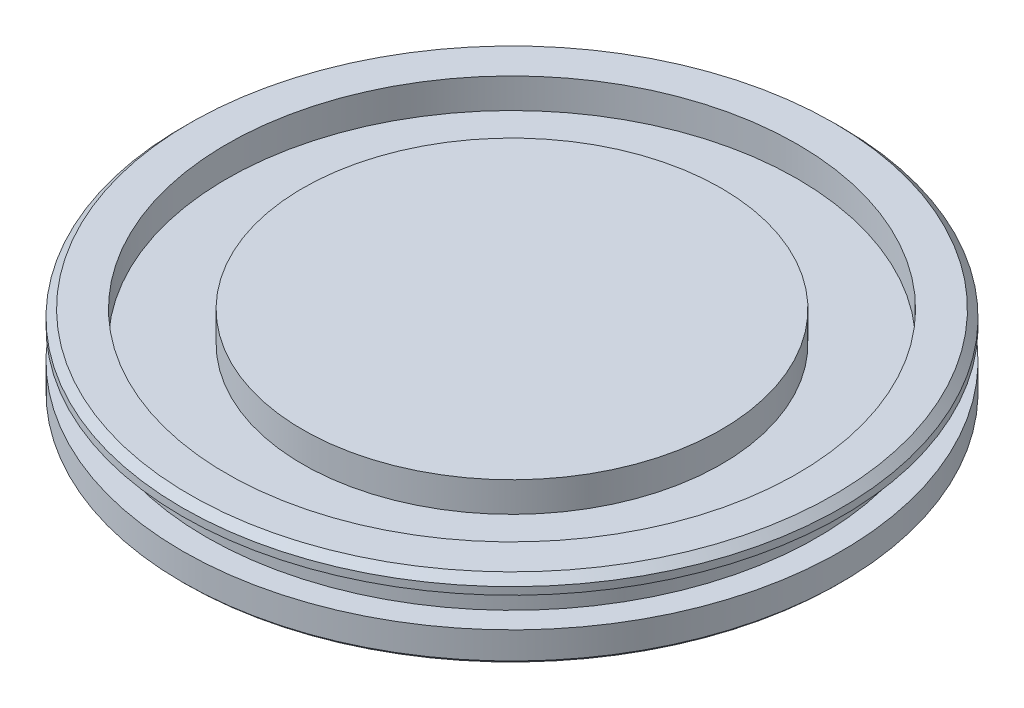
ISO-10303-21;
HEADER;
FILE_DESCRIPTION(('STEP AP214'),'2;1');
FILE_NAME('part.step','',(''),(''),'','','');
FILE_SCHEMA(('AUTOMOTIVE_DESIGN { 1 0 10303 214 1 1 1 1 }'));
ENDSEC;
DATA;
#1=APPLICATION_CONTEXT('core data for automotive mechanical design processes');
#2=APPLICATION_PROTOCOL_DEFINITION('international standard','automotive_design',2000,#1);
#3=PRODUCT_CONTEXT('',#1,'mechanical');
#4=PRODUCT('Part','Part','',(#3));
#5=PRODUCT_RELATED_PRODUCT_CATEGORY('part','',(#4));
#6=PRODUCT_DEFINITION_FORMATION('','',#4);
#7=PRODUCT_DEFINITION_CONTEXT('part definition',#1,'design');
#8=PRODUCT_DEFINITION('design','',#6,#7);
#9=PRODUCT_DEFINITION_SHAPE('','',#8);
#10=(LENGTH_UNIT() NAMED_UNIT(*) SI_UNIT(.MILLI.,.METRE.));
#11=(NAMED_UNIT(*) PLANE_ANGLE_UNIT() SI_UNIT($,.RADIAN.));
#12=(NAMED_UNIT(*) SI_UNIT($,.STERADIAN.) SOLID_ANGLE_UNIT());
#13=UNCERTAINTY_MEASURE_WITH_UNIT(LENGTH_MEASURE(1.E-05),#10,'distance_accuracy_value','');
#14=(GEOMETRIC_REPRESENTATION_CONTEXT(3) GLOBAL_UNCERTAINTY_ASSIGNED_CONTEXT((#13)) GLOBAL_UNIT_ASSIGNED_CONTEXT((#10,
#11,#12)) REPRESENTATION_CONTEXT('',''));
#15=CARTESIAN_POINT('',(0.,0.,0.));
#16=DIRECTION('',(0.,0.,1.));
#17=DIRECTION('',(1.,0.,0.));
#18=AXIS2_PLACEMENT_3D('',#15,#16,#17);
#19=CARTESIAN_POINT('',(0.,0.,0.));
#20=DIRECTION('',(0.,-1.,0.));
#21=DIRECTION('',(0.,0.,-1.));
#22=AXIS2_PLACEMENT_3D('',#19,#20,#21);
#23=PLANE('',#22);
#24=CARTESIAN_POINT('',(0.,0.,0.));
#25=DIRECTION('',(0.,-1.,0.));
#26=DIRECTION('',(0.,0.,-1.));
#27=AXIS2_PLACEMENT_3D('',#24,#25,#26);
#28=CIRCLE('',#27,6.985);
#29=CARTESIAN_POINT('',(0.,0.,-6.985));
#30=VERTEX_POINT('',#29);
#31=EDGE_CURVE('E51',#30,#30,#28,.T.);
#32=ORIENTED_EDGE('',*,*,#31,.F.);
#33=EDGE_LOOP('',(#32));
#34=FACE_BOUND('',#33,.T.);
#35=ADVANCED_FACE('F31',(#34),#23,.F.);
#36=CARTESIAN_POINT('',(0.,0.,0.));
#37=DIRECTION('',(0.,-1.,0.));
#38=DIRECTION('',(0.,0.,-1.));
#39=AXIS2_PLACEMENT_3D('',#36,#37,#38);
#40=CYLINDRICAL_SURFACE('',#39,6.985);
#41=CARTESIAN_POINT('',(0.,-1.,0.));
#42=DIRECTION('',(0.,-1.,0.));
#43=DIRECTION('',(0.,0.,-1.));
#44=AXIS2_PLACEMENT_3D('',#41,#42,#43);
#45=CIRCLE('',#44,6.985);
#46=CARTESIAN_POINT('',(0.,-1.,-6.985));
#47=VERTEX_POINT('',#46);
#48=EDGE_CURVE('E54',#47,#47,#45,.T.);
#49=ORIENTED_EDGE('',*,*,#48,.F.);
#50=EDGE_LOOP('',(#49));
#51=FACE_BOUND('',#50,.T.);
#52=ORIENTED_EDGE('',*,*,#31,.T.);
#53=EDGE_LOOP('',(#52));
#54=FACE_BOUND('',#53,.T.);
#55=ADVANCED_FACE('F108',(#51,#54),#40,.T.);
#56=CARTESIAN_POINT('',(-9.525,-1.,0.));
#57=DIRECTION('',(0.,-1.,0.));
#58=DIRECTION('',(0.,0.,-1.));
#59=AXIS2_PLACEMENT_3D('',#56,#57,#58);
#60=PLANE('',#59);
#61=CARTESIAN_POINT('',(0.,-1.,0.));
#62=DIRECTION('',(0.,-1.,0.));
#63=DIRECTION('',(0.,0.,-1.));
#64=AXIS2_PLACEMENT_3D('',#61,#62,#63);
#65=CIRCLE('',#64,9.525);
#66=CARTESIAN_POINT('',(0.,-1.,-9.525));
#67=VERTEX_POINT('',#66);
#68=EDGE_CURVE('E57',#67,#67,#65,.T.);
#69=ORIENTED_EDGE('',*,*,#68,.F.);
#70=EDGE_LOOP('',(#69));
#71=FACE_BOUND('',#70,.T.);
#72=ORIENTED_EDGE('',*,*,#48,.T.);
#73=EDGE_LOOP('',(#72));
#74=FACE_BOUND('',#73,.T.);
#75=ADVANCED_FACE('F114',(#71,#74),#60,.F.);
#76=CARTESIAN_POINT('',(0.,0.,0.));
#77=DIRECTION('',(0.,-1.,0.));
#78=DIRECTION('',(0.,0.,-1.));
#79=AXIS2_PLACEMENT_3D('',#76,#77,#78);
#80=CYLINDRICAL_SURFACE('',#79,9.525);
#81=CARTESIAN_POINT('',(0.,0.,0.));
#82=DIRECTION('',(0.,-1.,0.));
#83=DIRECTION('',(0.,0.,-1.));
#84=AXIS2_PLACEMENT_3D('',#81,#82,#83);
#85=CIRCLE('',#84,9.525);
#86=CARTESIAN_POINT('',(0.,0.,-9.525));
#87=VERTEX_POINT('',#86);
#88=EDGE_CURVE('E60',#87,#87,#85,.T.);
#89=ORIENTED_EDGE('',*,*,#88,.F.);
#90=EDGE_LOOP('',(#89));
#91=FACE_BOUND('',#90,.T.);
#92=ORIENTED_EDGE('',*,*,#68,.T.);
#93=EDGE_LOOP('',(#92));
#94=FACE_BOUND('',#93,.T.);
#95=ADVANCED_FACE('F104',(#91,#94),#80,.F.);
#96=CARTESIAN_POINT('',(-9.525,0.,0.));
#97=DIRECTION('',(0.,-1.,0.));
#98=DIRECTION('',(0.,0.,-1.));
#99=AXIS2_PLACEMENT_3D('',#96,#97,#98);
#100=PLANE('',#99);
#101=CARTESIAN_POINT('',(0.,0.,0.));
#102=DIRECTION('',(0.,-1.,0.));
#103=DIRECTION('',(0.,0.,-1.));
#104=AXIS2_PLACEMENT_3D('',#101,#102,#103);
#105=CIRCLE('',#104,10.75);
#106=CARTESIAN_POINT('',(0.,0.,-10.75));
#107=VERTEX_POINT('',#106);
#108=EDGE_CURVE('E42',#107,#107,#105,.F.);
#109=ORIENTED_EDGE('',*,*,#108,.T.);
#110=EDGE_LOOP('',(#109));
#111=FACE_BOUND('',#110,.T.);
#112=ORIENTED_EDGE('',*,*,#88,.T.);
#113=EDGE_LOOP('',(#112));
#114=FACE_BOUND('',#113,.T.);
#115=ADVANCED_FACE('F98',(#111,#114),#100,.F.);
#116=CARTESIAN_POINT('',(0.,0.,0.));
#117=DIRECTION('',(0.,-1.,0.));
#118=DIRECTION('',(0.,0.,-1.));
#119=AXIS2_PLACEMENT_3D('',#116,#117,#118);
#120=CYLINDRICAL_SURFACE('',#119,11.);
#121=CARTESIAN_POINT('',(0.,-0.250000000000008,0.));
#122=DIRECTION('',(0.,-1.,0.));
#123=DIRECTION('',(0.,0.,-1.));
#124=AXIS2_PLACEMENT_3D('',#121,#122,#123);
#125=CIRCLE('',#124,11.);
#126=CARTESIAN_POINT('',(0.,-0.250000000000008,-11.));
#127=VERTEX_POINT('',#126);
#128=EDGE_CURVE('E46',#127,#127,#125,.T.);
#129=ORIENTED_EDGE('',*,*,#128,.T.);
#130=EDGE_LOOP('',(#129));
#131=FACE_BOUND('',#130,.T.);
#132=CARTESIAN_POINT('',(0.,-0.499999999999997,0.));
#133=DIRECTION('',(0.,-1.,0.));
#134=DIRECTION('',(0.,0.,-1.));
#135=AXIS2_PLACEMENT_3D('',#132,#133,#134);
#136=CIRCLE('',#135,11.);
#137=CARTESIAN_POINT('',(0.,-0.499999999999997,-11.));
#138=VERTEX_POINT('',#137);
#139=EDGE_CURVE('E63',#138,#138,#136,.T.);
#140=ORIENTED_EDGE('',*,*,#139,.F.);
#141=EDGE_LOOP('',(#140));
#142=FACE_BOUND('',#141,.T.);
#143=ADVANCED_FACE('F93',(#131,#142),#120,.T.);
#144=CARTESIAN_POINT('',(-11.,-0.499999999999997,0.));
#145=DIRECTION('',(0.,1.,0.));
#146=DIRECTION('',(0.,0.,1.));
#147=AXIS2_PLACEMENT_3D('',#144,#145,#146);
#148=PLANE('',#147);
#149=CARTESIAN_POINT('',(0.,-0.499999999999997,0.));
#150=DIRECTION('',(0.,-1.,0.));
#151=DIRECTION('',(0.,0.,-1.));
#152=AXIS2_PLACEMENT_3D('',#149,#150,#151);
#153=CIRCLE('',#152,10.2);
#154=CARTESIAN_POINT('',(0.,-0.499999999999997,-10.2));
#155=VERTEX_POINT('',#154);
#156=EDGE_CURVE('E66',#155,#155,#153,.T.);
#157=ORIENTED_EDGE('',*,*,#156,.F.);
#158=EDGE_LOOP('',(#157));
#159=FACE_BOUND('',#158,.T.);
#160=ORIENTED_EDGE('',*,*,#139,.T.);
#161=EDGE_LOOP('',(#160));
#162=FACE_BOUND('',#161,.T.);
#163=ADVANCED_FACE('F87',(#159,#162),#148,.F.);
#164=CARTESIAN_POINT('',(0.,0.,0.));
#165=DIRECTION('',(0.,-1.,0.));
#166=DIRECTION('',(0.,0.,-1.));
#167=AXIS2_PLACEMENT_3D('',#164,#165,#166);
#168=CYLINDRICAL_SURFACE('',#167,10.2);
#169=CARTESIAN_POINT('',(0.,-1.5,0.));
#170=DIRECTION('',(0.,-1.,0.));
#171=DIRECTION('',(0.,0.,-1.));
#172=AXIS2_PLACEMENT_3D('',#169,#170,#171);
#173=CIRCLE('',#172,10.2);
#174=CARTESIAN_POINT('',(0.,-1.5,-10.2));
#175=VERTEX_POINT('',#174);
#176=EDGE_CURVE('E69',#175,#175,#173,.T.);
#177=ORIENTED_EDGE('',*,*,#176,.F.);
#178=EDGE_LOOP('',(#177));
#179=FACE_BOUND('',#178,.T.);
#180=ORIENTED_EDGE('',*,*,#156,.T.);
#181=EDGE_LOOP('',(#180));
#182=FACE_BOUND('',#181,.T.);
#183=ADVANCED_FACE('F81',(#179,#182),#168,.T.);
#184=CARTESIAN_POINT('',(-10.2,-1.5,0.));
#185=DIRECTION('',(0.,-1.,0.));
#186=DIRECTION('',(0.,0.,-1.));
#187=AXIS2_PLACEMENT_3D('',#184,#185,#186);
#188=PLANE('',#187);
#189=CARTESIAN_POINT('',(0.,-1.5,0.));
#190=DIRECTION('',(0.,-1.,0.));
#191=DIRECTION('',(0.,0.,-1.));
#192=AXIS2_PLACEMENT_3D('',#189,#190,#191);
#193=CIRCLE('',#192,11.);
#194=CARTESIAN_POINT('',(0.,-1.5,-11.));
#195=VERTEX_POINT('',#194);
#196=EDGE_CURVE('E72',#195,#195,#193,.T.);
#197=ORIENTED_EDGE('',*,*,#196,.F.);
#198=EDGE_LOOP('',(#197));
#199=FACE_BOUND('',#198,.T.);
#200=ORIENTED_EDGE('',*,*,#176,.T.);
#201=EDGE_LOOP('',(#200));
#202=FACE_BOUND('',#201,.T.);
#203=ADVANCED_FACE('F78',(#199,#202),#188,.F.);
#204=CARTESIAN_POINT('',(0.,0.,0.));
#205=DIRECTION('',(0.,-1.,0.));
#206=DIRECTION('',(0.,0.,-1.));
#207=AXIS2_PLACEMENT_3D('',#204,#205,#206);
#208=CYLINDRICAL_SURFACE('',#207,11.);
#209=CARTESIAN_POINT('',(0.,-2.4,0.));
#210=DIRECTION('',(0.,1.,0.));
#211=DIRECTION('',(0.,0.,1.));
#212=AXIS2_PLACEMENT_3D('',#209,#210,#211);
#213=CIRCLE('',#212,11.);
#214=CARTESIAN_POINT('',(0.,-2.4,11.));
#215=VERTEX_POINT('',#214);
#216=EDGE_CURVE('E10',#215,#215,#213,.T.);
#217=ORIENTED_EDGE('',*,*,#216,.T.);
#218=EDGE_LOOP('',(#217));
#219=FACE_BOUND('',#218,.T.);
#220=ORIENTED_EDGE('',*,*,#196,.T.);
#221=EDGE_LOOP('',(#220));
#222=FACE_BOUND('',#221,.T.);
#223=ADVANCED_FACE('F76',(#219,#222),#208,.T.);
#224=CARTESIAN_POINT('',(-11.,-2.5,0.));
#225=DIRECTION('',(0.,1.,0.));
#226=DIRECTION('',(0.,0.,1.));
#227=AXIS2_PLACEMENT_3D('',#224,#225,#226);
#228=PLANE('',#227);
#229=CARTESIAN_POINT('',(0.,-2.5,0.));
#230=DIRECTION('',(0.,1.,0.));
#231=DIRECTION('',(0.,0.,1.));
#232=AXIS2_PLACEMENT_3D('',#229,#230,#231);
#233=CIRCLE('',#232,10.9);
#234=CARTESIAN_POINT('',(0.,-2.5,10.9));
#235=VERTEX_POINT('',#234);
#236=EDGE_CURVE('E38',#235,#235,#233,.F.);
#237=ORIENTED_EDGE('',*,*,#236,.T.);
#238=EDGE_LOOP('',(#237));
#239=FACE_BOUND('',#238,.T.);
#240=ADVANCED_FACE('F121',(#239),#228,.F.);
#241=CARTESIAN_POINT('',(0.,-0.250000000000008,0.));
#242=DIRECTION('',(0.,-1.,0.));
#243=DIRECTION('',(0.,0.,-1.));
#244=AXIS2_PLACEMENT_3D('',#241,#242,#243);
#245=CONICAL_SURFACE('',#244,11.,0.785398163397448);
#246=ORIENTED_EDGE('',*,*,#108,.F.);
#247=EDGE_LOOP('',(#246));
#248=FACE_BOUND('',#247,.T.);
#249=ORIENTED_EDGE('',*,*,#128,.F.);
#250=EDGE_LOOP('',(#249));
#251=FACE_BOUND('',#250,.T.);
#252=ADVANCED_FACE('F119',(#248,#251),#245,.T.);
#253=CARTESIAN_POINT('',(0.,-2.5,0.));
#254=DIRECTION('',(0.,1.,0.));
#255=DIRECTION('',(0.,0.,1.));
#256=AXIS2_PLACEMENT_3D('',#253,#254,#255);
#257=CONICAL_SURFACE('',#256,10.9,0.785398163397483);
#258=ORIENTED_EDGE('',*,*,#216,.F.);
#259=EDGE_LOOP('',(#258));
#260=FACE_BOUND('',#259,.T.);
#261=ORIENTED_EDGE('',*,*,#236,.F.);
#262=EDGE_LOOP('',(#261));
#263=FACE_BOUND('',#262,.T.);
#264=ADVANCED_FACE('F33',(#260,#263),#257,.T.);
#265=CLOSED_SHELL('',(#35,#55,#75,#95,#115,#143,#163,#183,#203,#223,#240,#252,#264));
#266=MANIFOLD_SOLID_BREP('B2',#265);
#267=ADVANCED_BREP_SHAPE_REPRESENTATION('',(#18,#266),#14);
#268=SHAPE_DEFINITION_REPRESENTATION(#9,#267);
ENDSEC;
END-ISO-10303-21;
